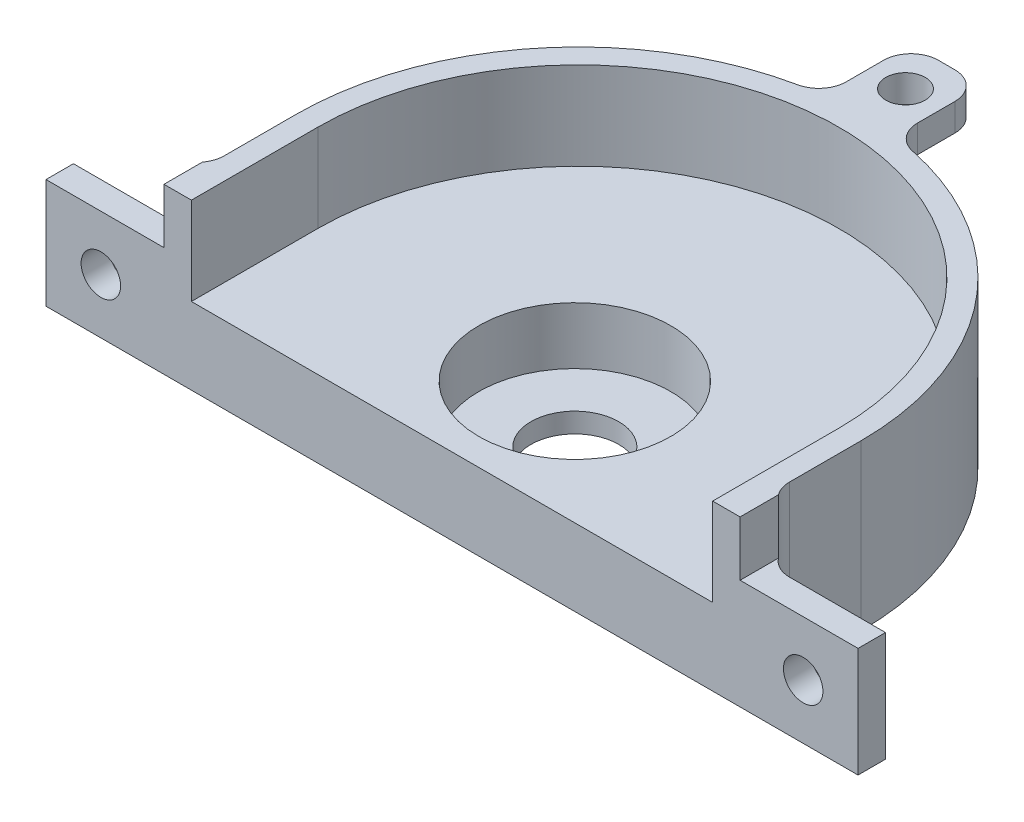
ISO-10303-21;
HEADER;
FILE_DESCRIPTION(('STEP AP214'),'2;1');
FILE_NAME('part.step','',(''),(''),'','','');
FILE_SCHEMA(('AUTOMOTIVE_DESIGN { 1 0 10303 214 1 1 1 1 }'));
ENDSEC;
DATA;
#1=APPLICATION_CONTEXT('core data for automotive mechanical design processes');
#2=APPLICATION_PROTOCOL_DEFINITION('international standard','automotive_design',2000,#1);
#3=PRODUCT_CONTEXT('',#1,'mechanical');
#4=PRODUCT('Part','Part','',(#3));
#5=PRODUCT_RELATED_PRODUCT_CATEGORY('part','',(#4));
#6=PRODUCT_DEFINITION_FORMATION('','',#4);
#7=PRODUCT_DEFINITION_CONTEXT('part definition',#1,'design');
#8=PRODUCT_DEFINITION('design','',#6,#7);
#9=PRODUCT_DEFINITION_SHAPE('','',#8);
#10=(LENGTH_UNIT() NAMED_UNIT(*) SI_UNIT(.MILLI.,.METRE.));
#11=(NAMED_UNIT(*) PLANE_ANGLE_UNIT() SI_UNIT($,.RADIAN.));
#12=(NAMED_UNIT(*) SI_UNIT($,.STERADIAN.) SOLID_ANGLE_UNIT());
#13=UNCERTAINTY_MEASURE_WITH_UNIT(LENGTH_MEASURE(1.E-05),#10,'distance_accuracy_value','');
#14=(GEOMETRIC_REPRESENTATION_CONTEXT(3) GLOBAL_UNCERTAINTY_ASSIGNED_CONTEXT((#13)) GLOBAL_UNIT_ASSIGNED_CONTEXT((#10,
#11,#12)) REPRESENTATION_CONTEXT('',''));
#15=CARTESIAN_POINT('',(0.,0.,0.));
#16=DIRECTION('',(0.,0.,1.));
#17=DIRECTION('',(1.,0.,0.));
#18=AXIS2_PLACEMENT_3D('',#15,#16,#17);
#19=CARTESIAN_POINT('',(50.8,19.05,-38.1));
#20=DIRECTION('',(0.,-1.,0.));
#21=DIRECTION('',(0.,0.,-1.));
#22=AXIS2_PLACEMENT_3D('',#19,#20,#21);
#23=PLANE('',#22);
#24=DIRECTION('',(0.,0.,-1.));
#25=VECTOR('',#24,1.);
#26=CARTESIAN_POINT('',(4.1275,19.05,-20.2865143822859));
#27=LINE('',#26,#25);
#28=CARTESIAN_POINT('',(4.1275,19.05,-12.7935143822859));
#29=VERTEX_POINT('',#28);
#30=CARTESIAN_POINT('',(4.1275,19.05,-17.1115143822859));
#31=VERTEX_POINT('',#30);
#32=EDGE_CURVE('E259',#29,#31,#27,.T.);
#33=ORIENTED_EDGE('',*,*,#32,.T.);
#34=CARTESIAN_POINT('',(0.9525,19.05,-17.1115143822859));
#35=DIRECTION('',(0.,-1.,0.));
#36=DIRECTION('',(0.,0.,-1.));
#37=AXIS2_PLACEMENT_3D('',#34,#35,#36);
#38=CIRCLE('',#37,3.175);
#39=CARTESIAN_POINT('',(0.9525,19.05,-20.2865143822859));
#40=VERTEX_POINT('',#39);
#41=EDGE_CURVE('E360',#31,#40,#38,.F.);
#42=ORIENTED_EDGE('',*,*,#41,.T.);
#43=DIRECTION('',(-1.,0.,0.));
#44=VECTOR('',#43,1.);
#45=CARTESIAN_POINT('',(-4.1275,19.05,-20.2865143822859));
#46=LINE('',#45,#44);
#47=CARTESIAN_POINT('',(-0.9525,19.05,-20.2865143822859));
#48=VERTEX_POINT('',#47);
#49=EDGE_CURVE('E261',#40,#48,#46,.T.);
#50=ORIENTED_EDGE('',*,*,#49,.T.);
#51=CARTESIAN_POINT('',(-0.9525,19.05,-17.1115143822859));
#52=DIRECTION('',(0.,-1.,0.));
#53=DIRECTION('',(0.,0.,-1.));
#54=AXIS2_PLACEMENT_3D('',#51,#52,#53);
#55=CIRCLE('',#54,3.175);
#56=CARTESIAN_POINT('',(-4.1275,19.05,-17.1115143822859));
#57=VERTEX_POINT('',#56);
#58=EDGE_CURVE('E358',#48,#57,#55,.F.);
#59=ORIENTED_EDGE('',*,*,#58,.T.);
#60=DIRECTION('',(0.,0.,1.));
#61=VECTOR('',#60,1.);
#62=CARTESIAN_POINT('',(-4.1275,19.05,-20.2865143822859));
#63=LINE('',#62,#61);
#64=CARTESIAN_POINT('',(-4.1275,19.05,-12.7935143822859));
#65=VERTEX_POINT('',#64);
#66=EDGE_CURVE('E264',#57,#65,#63,.T.);
#67=ORIENTED_EDGE('',*,*,#66,.T.);
#68=CARTESIAN_POINT('',(-7.3025,19.05,-12.7935143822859));
#69=DIRECTION('',(0.,-1.,0.));
#70=DIRECTION('',(0.,0.,-1.));
#71=AXIS2_PLACEMENT_3D('',#68,#69,#70);
#72=CIRCLE('',#71,3.175);
#73=CARTESIAN_POINT('',(-6.65626106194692,19.05,-9.68497771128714));
#74=VERTEX_POINT('',#73);
#75=EDGE_CURVE('E266',#65,#74,#72,.T.);
#76=ORIENTED_EDGE('',*,*,#75,.T.);
#77=CARTESIAN_POINT('',(0.,19.05,22.33295));
#78=DIRECTION('',(0.,1.,0.));
#79=DIRECTION('',(0.,0.,-1.));
#80=AXIS2_PLACEMENT_3D('',#77,#78,#79);
#81=CIRCLE('',#80,32.7025);
#82=CARTESIAN_POINT('',(-32.7025,19.05,22.33295));
#83=VERTEX_POINT('',#82);
#84=EDGE_CURVE('E269',#74,#83,#81,.T.);
#85=ORIENTED_EDGE('',*,*,#84,.T.);
#86=DIRECTION('',(0.,0.,1.));
#87=VECTOR('',#86,1.);
#88=CARTESIAN_POINT('',(-32.7025,19.05,30.607));
#89=LINE('',#88,#87);
#90=CARTESIAN_POINT('',(-32.7025,19.05,30.607));
#91=VERTEX_POINT('',#90);
#92=EDGE_CURVE('E272',#83,#91,#89,.T.);
#93=ORIENTED_EDGE('',*,*,#92,.T.);
#94=CARTESIAN_POINT('',(-35.8775,19.05,30.607));
#95=DIRECTION('',(0.,-1.,0.));
#96=DIRECTION('',(0.,0.,-1.));
#97=AXIS2_PLACEMENT_3D('',#94,#95,#96);
#98=CIRCLE('',#97,3.175);
#99=CARTESIAN_POINT('',(-33.3375,19.05,32.512));
#100=VERTEX_POINT('',#99);
#101=EDGE_CURVE('E275',#91,#100,#98,.T.);
#102=ORIENTED_EDGE('',*,*,#101,.T.);
#103=DIRECTION('',(0.,0.,1.));
#104=VECTOR('',#103,1.);
#105=CARTESIAN_POINT('',(-33.3375,19.05,-20.2865143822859));
#106=LINE('',#105,#104);
#107=CARTESIAN_POINT('',(-33.3375,19.05,36.957));
#108=VERTEX_POINT('',#107);
#109=EDGE_CURVE('E417',#100,#108,#106,.T.);
#110=ORIENTED_EDGE('',*,*,#109,.T.);
#111=DIRECTION('',(1.,0.,0.));
#112=VECTOR('',#111,1.);
#113=CARTESIAN_POINT('',(50.8,19.05,36.957));
#114=LINE('',#113,#112);
#115=CARTESIAN_POINT('',(-30.1625,19.05,36.957));
#116=VERTEX_POINT('',#115);
#117=EDGE_CURVE('E238',#108,#116,#114,.T.);
#118=ORIENTED_EDGE('',*,*,#117,.T.);
#119=DIRECTION('',(0.,0.,1.));
#120=VECTOR('',#119,1.);
#121=CARTESIAN_POINT('',(-30.1625,19.05,22.33295));
#122=LINE('',#121,#120);
#123=CARTESIAN_POINT('',(-30.1625,19.05,22.33295));
#124=VERTEX_POINT('',#123);
#125=EDGE_CURVE('E316',#124,#116,#122,.T.);
#126=ORIENTED_EDGE('',*,*,#125,.F.);
#127=CARTESIAN_POINT('',(0.,19.05,22.33295));
#128=DIRECTION('',(0.,1.,0.));
#129=DIRECTION('',(0.,0.,1.));
#130=AXIS2_PLACEMENT_3D('',#127,#128,#129);
#131=CIRCLE('',#130,30.1625);
#132=CARTESIAN_POINT('',(30.1625,19.05,22.33295));
#133=VERTEX_POINT('',#132);
#134=EDGE_CURVE('E311',#133,#124,#131,.T.);
#135=ORIENTED_EDGE('',*,*,#134,.F.);
#136=DIRECTION('',(0.,0.,1.));
#137=VECTOR('',#136,1.);
#138=CARTESIAN_POINT('',(30.1625,19.05,-38.1));
#139=LINE('',#138,#137);
#140=CARTESIAN_POINT('',(30.1625,19.05,36.957));
#141=VERTEX_POINT('',#140);
#142=EDGE_CURVE('E237',#133,#141,#139,.T.);
#143=ORIENTED_EDGE('',*,*,#142,.T.);
#144=CARTESIAN_POINT('',(33.3375,19.05,36.957));
#145=VERTEX_POINT('',#144);
#146=EDGE_CURVE('E227',#141,#145,#114,.T.);
#147=ORIENTED_EDGE('',*,*,#146,.T.);
#148=DIRECTION('',(0.,0.,1.));
#149=VECTOR('',#148,1.);
#150=CARTESIAN_POINT('',(33.3375,19.05,-20.2865143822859));
#151=LINE('',#150,#149);
#152=CARTESIAN_POINT('',(33.3375,19.05,32.512));
#153=VERTEX_POINT('',#152);
#154=EDGE_CURVE('E210',#153,#145,#151,.T.);
#155=ORIENTED_EDGE('',*,*,#154,.F.);
#156=CARTESIAN_POINT('',(35.8775,19.05,30.607));
#157=DIRECTION('',(0.,-1.,0.));
#158=DIRECTION('',(0.,0.,1.));
#159=AXIS2_PLACEMENT_3D('',#156,#157,#158);
#160=CIRCLE('',#159,3.175);
#161=CARTESIAN_POINT('',(32.7025,19.05,30.607));
#162=VERTEX_POINT('',#161);
#163=EDGE_CURVE('E241',#153,#162,#160,.T.);
#164=ORIENTED_EDGE('',*,*,#163,.T.);
#165=DIRECTION('',(0.,0.,-1.));
#166=VECTOR('',#165,1.);
#167=CARTESIAN_POINT('',(32.7025,19.05,30.607));
#168=LINE('',#167,#166);
#169=CARTESIAN_POINT('',(32.7025,19.05,22.33295));
#170=VERTEX_POINT('',#169);
#171=EDGE_CURVE('E250',#162,#170,#168,.T.);
#172=ORIENTED_EDGE('',*,*,#171,.T.);
#173=CARTESIAN_POINT('',(0.,19.05,22.33295));
#174=DIRECTION('',(0.,1.,0.));
#175=DIRECTION('',(0.,0.,1.));
#176=AXIS2_PLACEMENT_3D('',#173,#174,#175);
#177=CIRCLE('',#176,32.7025);
#178=CARTESIAN_POINT('',(6.6562610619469,19.05,-9.68497771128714));
#179=VERTEX_POINT('',#178);
#180=EDGE_CURVE('E253',#170,#179,#177,.T.);
#181=ORIENTED_EDGE('',*,*,#180,.T.);
#182=CARTESIAN_POINT('',(7.3025,19.05,-12.7935143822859));
#183=DIRECTION('',(0.,-1.,0.));
#184=DIRECTION('',(0.,0.,1.));
#185=AXIS2_PLACEMENT_3D('',#182,#183,#184);
#186=CIRCLE('',#185,3.175);
#187=EDGE_CURVE('E256',#179,#29,#186,.T.);
#188=ORIENTED_EDGE('',*,*,#187,.T.);
#189=EDGE_LOOP('',(#33,#42,#50,#59,#67,#76,#85,#93,#102,#110,#118,#126,#135,#143,#147,#155,#164,
#172,#181,#188));
#190=FACE_BOUND('',#189,.T.);
#191=CARTESIAN_POINT('',(0.,19.05,-15.5240143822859));
#192=DIRECTION('',(0.,1.,0.));
#193=DIRECTION('',(0.,0.,1.));
#194=AXIS2_PLACEMENT_3D('',#191,#192,#193);
#195=CIRCLE('',#194,2.286);
#196=CARTESIAN_POINT('',(0.,19.05,-17.8100143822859));
#197=VERTEX_POINT('',#196);
#198=EDGE_CURVE('E355',#197,#197,#195,.T.);
#199=ORIENTED_EDGE('',*,*,#198,.F.);
#200=EDGE_LOOP('',(#199));
#201=FACE_BOUND('',#200,.T.);
#202=ADVANCED_FACE('F35',(#190,#201),#23,.F.);
#203=CARTESIAN_POINT('',(0.,15.875,22.33295));
#204=DIRECTION('',(0.,1.,0.));
#205=DIRECTION('',(0.,0.,1.));
#206=AXIS2_PLACEMENT_3D('',#203,#204,#205);
#207=PLANE('',#206);
#208=DIRECTION('',(1.,0.,0.));
#209=VECTOR('',#208,1.);
#210=CARTESIAN_POINT('',(-4.1275,15.875,-20.2865143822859));
#211=LINE('',#210,#209);
#212=CARTESIAN_POINT('',(-0.9525,15.875,-20.2865143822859));
#213=VERTEX_POINT('',#212);
#214=CARTESIAN_POINT('',(0.9525,15.875,-20.2865143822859));
#215=VERTEX_POINT('',#214);
#216=EDGE_CURVE('E374',#213,#215,#211,.T.);
#217=ORIENTED_EDGE('',*,*,#216,.T.);
#218=CARTESIAN_POINT('',(0.9525,15.875,-17.1115143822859));
#219=DIRECTION('',(0.,1.,0.));
#220=DIRECTION('',(0.,0.,1.));
#221=AXIS2_PLACEMENT_3D('',#218,#219,#220);
#222=CIRCLE('',#221,3.175);
#223=CARTESIAN_POINT('',(4.1275,15.875,-17.1115143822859));
#224=VERTEX_POINT('',#223);
#225=EDGE_CURVE('E43',#215,#224,#222,.F.);
#226=ORIENTED_EDGE('',*,*,#225,.T.);
#227=DIRECTION('',(0.,0.,1.));
#228=VECTOR('',#227,1.);
#229=CARTESIAN_POINT('',(4.1275,15.875,-20.2865143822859));
#230=LINE('',#229,#228);
#231=CARTESIAN_POINT('',(4.1275,15.875,-12.7935143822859));
#232=VERTEX_POINT('',#231);
#233=EDGE_CURVE('E372',#224,#232,#230,.T.);
#234=ORIENTED_EDGE('',*,*,#233,.T.);
#235=CARTESIAN_POINT('',(7.3025,15.875,-12.7935143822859));
#236=DIRECTION('',(0.,1.,0.));
#237=DIRECTION('',(0.,0.,1.));
#238=AXIS2_PLACEMENT_3D('',#235,#236,#237);
#239=CIRCLE('',#238,3.175);
#240=CARTESIAN_POINT('',(6.6562610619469,15.875,-9.68497771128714));
#241=VERTEX_POINT('',#240);
#242=EDGE_CURVE('E381',#232,#241,#239,.T.);
#243=ORIENTED_EDGE('',*,*,#242,.T.);
#244=CARTESIAN_POINT('',(0.,15.875,22.33295));
#245=DIRECTION('',(0.,-1.,0.));
#246=DIRECTION('',(0.,0.,1.));
#247=AXIS2_PLACEMENT_3D('',#244,#245,#246);
#248=CIRCLE('',#247,32.7025);
#249=CARTESIAN_POINT('',(-6.6562610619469,15.875,-9.68497771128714));
#250=VERTEX_POINT('',#249);
#251=EDGE_CURVE('E597',#250,#241,#248,.T.);
#252=ORIENTED_EDGE('',*,*,#251,.F.);
#253=CARTESIAN_POINT('',(-7.3025,15.875,-12.7935143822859));
#254=DIRECTION('',(0.,1.,0.));
#255=DIRECTION('',(0.,0.,1.));
#256=AXIS2_PLACEMENT_3D('',#253,#254,#255);
#257=CIRCLE('',#256,3.175);
#258=CARTESIAN_POINT('',(-4.1275,15.875,-12.7935143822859));
#259=VERTEX_POINT('',#258);
#260=EDGE_CURVE('E602',#250,#259,#257,.T.);
#261=ORIENTED_EDGE('',*,*,#260,.T.);
#262=DIRECTION('',(0.,0.,-1.));
#263=VECTOR('',#262,1.);
#264=CARTESIAN_POINT('',(-4.1275,15.875,-20.2865143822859));
#265=LINE('',#264,#263);
#266=CARTESIAN_POINT('',(-4.1275,15.875,-17.1115143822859));
#267=VERTEX_POINT('',#266);
#268=EDGE_CURVE('E391',#259,#267,#265,.T.);
#269=ORIENTED_EDGE('',*,*,#268,.T.);
#270=CARTESIAN_POINT('',(-0.9525,15.875,-17.1115143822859));
#271=DIRECTION('',(0.,1.,0.));
#272=DIRECTION('',(0.,0.,1.));
#273=AXIS2_PLACEMENT_3D('',#270,#271,#272);
#274=CIRCLE('',#273,3.175);
#275=EDGE_CURVE('E366',#267,#213,#274,.F.);
#276=ORIENTED_EDGE('',*,*,#275,.T.);
#277=EDGE_LOOP('',(#217,#226,#234,#243,#252,#261,#269,#276));
#278=FACE_BOUND('',#277,.T.);
#279=CARTESIAN_POINT('',(0.,15.875,-15.5240143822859));
#280=DIRECTION('',(0.,1.,0.));
#281=DIRECTION('',(0.,0.,1.));
#282=AXIS2_PLACEMENT_3D('',#279,#280,#281);
#283=CIRCLE('',#282,2.286);
#284=CARTESIAN_POINT('',(0.,15.875,-17.8100143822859));
#285=VERTEX_POINT('',#284);
#286=EDGE_CURVE('E231',#285,#285,#283,.F.);
#287=ORIENTED_EDGE('',*,*,#286,.F.);
#288=EDGE_LOOP('',(#287));
#289=FACE_BOUND('',#288,.T.);
#290=ADVANCED_FACE('F370',(#278,#289),#207,.F.);
#291=CARTESIAN_POINT('',(50.8,0.,36.957));
#292=DIRECTION('',(0.,0.,1.));
#293=DIRECTION('',(1.,0.,0.));
#294=AXIS2_PLACEMENT_3D('',#291,#292,#293);
#295=PLANE('',#294);
#296=DIRECTION('',(0.,-1.,0.));
#297=VECTOR('',#296,1.);
#298=CARTESIAN_POINT('',(46.99,0.,36.957));
#299=LINE('',#298,#297);
#300=CARTESIAN_POINT('',(46.99,12.7,36.957));
#301=VERTEX_POINT('',#300);
#302=CARTESIAN_POINT('',(46.99,0.,36.957));
#303=VERTEX_POINT('',#302);
#304=EDGE_CURVE('E221',#301,#303,#299,.T.);
#305=ORIENTED_EDGE('',*,*,#304,.F.);
#306=DIRECTION('',(1.,0.,0.));
#307=VECTOR('',#306,1.);
#308=CARTESIAN_POINT('',(46.99,12.7,36.957));
#309=LINE('',#308,#307);
#310=CARTESIAN_POINT('',(33.3375,12.7,36.957));
#311=VERTEX_POINT('',#310);
#312=EDGE_CURVE('E230',#311,#301,#309,.T.);
#313=ORIENTED_EDGE('',*,*,#312,.F.);
#314=DIRECTION('',(0.,-1.,0.));
#315=VECTOR('',#314,1.);
#316=CARTESIAN_POINT('',(33.3375,12.7,36.957));
#317=LINE('',#316,#315);
#318=EDGE_CURVE('E213',#145,#311,#317,.T.);
#319=ORIENTED_EDGE('',*,*,#318,.F.);
#320=ORIENTED_EDGE('',*,*,#146,.F.);
#321=DIRECTION('',(0.,-1.,0.));
#322=VECTOR('',#321,1.);
#323=CARTESIAN_POINT('',(30.1625,8.89,36.957));
#324=LINE('',#323,#322);
#325=CARTESIAN_POINT('',(30.1625,8.89,36.957));
#326=VERTEX_POINT('',#325);
#327=EDGE_CURVE('E306',#141,#326,#324,.T.);
#328=ORIENTED_EDGE('',*,*,#327,.T.);
#329=DIRECTION('',(1.,0.,0.));
#330=VECTOR('',#329,1.);
#331=CARTESIAN_POINT('',(0.,8.89,36.957));
#332=LINE('',#331,#330);
#333=CARTESIAN_POINT('',(-30.1625,8.89,36.957));
#334=VERTEX_POINT('',#333);
#335=EDGE_CURVE('E282',#334,#326,#332,.T.);
#336=ORIENTED_EDGE('',*,*,#335,.F.);
#337=DIRECTION('',(0.,1.,0.));
#338=VECTOR('',#337,1.);
#339=CARTESIAN_POINT('',(-30.1625,8.89,36.957));
#340=LINE('',#339,#338);
#341=EDGE_CURVE('E331',#334,#116,#340,.T.);
#342=ORIENTED_EDGE('',*,*,#341,.T.);
#343=ORIENTED_EDGE('',*,*,#117,.F.);
#344=DIRECTION('',(0.,1.,0.));
#345=VECTOR('',#344,1.);
#346=CARTESIAN_POINT('',(-33.3375,12.7,36.957));
#347=LINE('',#346,#345);
#348=CARTESIAN_POINT('',(-33.3375,12.7,36.957));
#349=VERTEX_POINT('',#348);
#350=EDGE_CURVE('E426',#349,#108,#347,.T.);
#351=ORIENTED_EDGE('',*,*,#350,.F.);
#352=DIRECTION('',(1.,0.,0.));
#353=VECTOR('',#352,1.);
#354=CARTESIAN_POINT('',(-46.99,12.7,36.957));
#355=LINE('',#354,#353);
#356=CARTESIAN_POINT('',(-46.99,12.7,36.957));
#357=VERTEX_POINT('',#356);
#358=EDGE_CURVE('E591',#357,#349,#355,.T.);
#359=ORIENTED_EDGE('',*,*,#358,.F.);
#360=DIRECTION('',(0.,1.,0.));
#361=VECTOR('',#360,1.);
#362=CARTESIAN_POINT('',(-46.99,0.,36.957));
#363=LINE('',#362,#361);
#364=CARTESIAN_POINT('',(-46.99,0.,36.957));
#365=VERTEX_POINT('',#364);
#366=EDGE_CURVE('E622',#365,#357,#363,.T.);
#367=ORIENTED_EDGE('',*,*,#366,.F.);
#368=DIRECTION('',(1.,0.,0.));
#369=VECTOR('',#368,1.);
#370=CARTESIAN_POINT('',(-50.8,0.,36.957));
#371=LINE('',#370,#369);
#372=EDGE_CURVE('E278',#365,#303,#371,.T.);
#373=ORIENTED_EDGE('',*,*,#372,.T.);
#374=EDGE_LOOP('',(#305,#313,#319,#320,#328,#336,#342,#343,#351,#359,#367,#373));
#375=FACE_BOUND('',#374,.T.);
#376=CARTESIAN_POINT('',(-40.64,6.35,36.957));
#377=DIRECTION('',(0.,0.,1.));
#378=DIRECTION('',(1.,0.,0.));
#379=AXIS2_PLACEMENT_3D('',#376,#377,#378);
#380=CIRCLE('',#379,2.28599999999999);
#381=CARTESIAN_POINT('',(-38.354,6.35,36.957));
#382=VERTEX_POINT('',#381);
#383=EDGE_CURVE('E339',#382,#382,#380,.T.);
#384=ORIENTED_EDGE('',*,*,#383,.F.);
#385=EDGE_LOOP('',(#384));
#386=FACE_BOUND('',#385,.T.);
#387=CARTESIAN_POINT('',(40.64,6.35,36.957));
#388=DIRECTION('',(0.,0.,1.));
#389=DIRECTION('',(-1.,0.,0.));
#390=AXIS2_PLACEMENT_3D('',#387,#388,#389);
#391=CIRCLE('',#390,2.28599999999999);
#392=CARTESIAN_POINT('',(38.354,6.35,36.957));
#393=VERTEX_POINT('',#392);
#394=EDGE_CURVE('E343',#393,#393,#391,.T.);
#395=ORIENTED_EDGE('',*,*,#394,.F.);
#396=EDGE_LOOP('',(#395));
#397=FACE_BOUND('',#396,.T.);
#398=ADVANCED_FACE('F225',(#375,#386,#397),#295,.T.);
#399=CARTESIAN_POINT('',(50.8,0.,33.782));
#400=DIRECTION('',(0.,0.,-1.));
#401=DIRECTION('',(-1.,0.,0.));
#402=AXIS2_PLACEMENT_3D('',#399,#400,#401);
#403=PLANE('',#402);
#404=DIRECTION('',(0.,1.,0.));
#405=VECTOR('',#404,1.);
#406=CARTESIAN_POINT('',(46.99,0.,33.782));
#407=LINE('',#406,#405);
#408=CARTESIAN_POINT('',(46.99,0.,33.782));
#409=VERTEX_POINT('',#408);
#410=CARTESIAN_POINT('',(46.99,12.7,33.782));
#411=VERTEX_POINT('',#410);
#412=EDGE_CURVE('E620',#409,#411,#407,.T.);
#413=ORIENTED_EDGE('',*,*,#412,.F.);
#414=DIRECTION('',(-1.,0.,0.));
#415=VECTOR('',#414,1.);
#416=CARTESIAN_POINT('',(50.8,0.,33.782));
#417=LINE('',#416,#415);
#418=CARTESIAN_POINT('',(35.8775,0.,33.782));
#419=VERTEX_POINT('',#418);
#420=EDGE_CURVE('E565',#409,#419,#417,.T.);
#421=ORIENTED_EDGE('',*,*,#420,.T.);
#422=DIRECTION('',(0.,1.,0.));
#423=VECTOR('',#422,1.);
#424=CARTESIAN_POINT('',(35.8775,0.,33.782));
#425=LINE('',#424,#423);
#426=CARTESIAN_POINT('',(35.8775,12.7,33.782));
#427=VERTEX_POINT('',#426);
#428=EDGE_CURVE('E301',#419,#427,#425,.T.);
#429=ORIENTED_EDGE('',*,*,#428,.T.);
#430=DIRECTION('',(-1.,0.,0.));
#431=VECTOR('',#430,1.);
#432=CARTESIAN_POINT('',(50.8,12.7,33.782));
#433=LINE('',#432,#431);
#434=EDGE_CURVE('E619',#411,#427,#433,.T.);
#435=ORIENTED_EDGE('',*,*,#434,.F.);
#436=EDGE_LOOP('',(#413,#421,#429,#435));
#437=FACE_BOUND('',#436,.T.);
#438=CARTESIAN_POINT('',(40.64,6.35,33.782));
#439=DIRECTION('',(0.,0.,-1.));
#440=DIRECTION('',(-1.,0.,0.));
#441=AXIS2_PLACEMENT_3D('',#438,#439,#440);
#442=CIRCLE('',#441,2.28599999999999);
#443=CARTESIAN_POINT('',(38.354,6.35,33.782));
#444=VERTEX_POINT('',#443);
#445=EDGE_CURVE('E340',#444,#444,#442,.F.);
#446=ORIENTED_EDGE('',*,*,#445,.T.);
#447=EDGE_LOOP('',(#446));
#448=FACE_BOUND('',#447,.T.);
#449=ADVANCED_FACE('F516',(#437,#448),#403,.T.);
#450=CARTESIAN_POINT('',(-50.8,0.,33.782));
#451=DIRECTION('',(0.,0.,-1.));
#452=DIRECTION('',(-1.,0.,0.));
#453=AXIS2_PLACEMENT_3D('',#450,#451,#452);
#454=PLANE('',#453);
#455=DIRECTION('',(-1.,0.,0.));
#456=VECTOR('',#455,1.);
#457=CARTESIAN_POINT('',(-50.8,12.7,33.782));
#458=LINE('',#457,#456);
#459=CARTESIAN_POINT('',(-35.8775,12.7,33.782));
#460=VERTEX_POINT('',#459);
#461=CARTESIAN_POINT('',(-46.99,12.7,33.782));
#462=VERTEX_POINT('',#461);
#463=EDGE_CURVE('E421',#460,#462,#458,.T.);
#464=ORIENTED_EDGE('',*,*,#463,.F.);
#465=DIRECTION('',(0.,1.,0.));
#466=VECTOR('',#465,1.);
#467=CARTESIAN_POINT('',(-35.8775,0.,33.782));
#468=LINE('',#467,#466);
#469=CARTESIAN_POINT('',(-35.8775,0.,33.782));
#470=VERTEX_POINT('',#469);
#471=EDGE_CURVE('E279',#470,#460,#468,.T.);
#472=ORIENTED_EDGE('',*,*,#471,.F.);
#473=DIRECTION('',(-1.,0.,0.));
#474=VECTOR('',#473,1.);
#475=CARTESIAN_POINT('',(-50.8,0.,33.782));
#476=LINE('',#475,#474);
#477=CARTESIAN_POINT('',(-46.99,0.,33.782));
#478=VERTEX_POINT('',#477);
#479=EDGE_CURVE('E247',#470,#478,#476,.T.);
#480=ORIENTED_EDGE('',*,*,#479,.T.);
#481=DIRECTION('',(0.,-1.,0.));
#482=VECTOR('',#481,1.);
#483=CARTESIAN_POINT('',(-46.99,0.,33.782));
#484=LINE('',#483,#482);
#485=EDGE_CURVE('E580',#462,#478,#484,.T.);
#486=ORIENTED_EDGE('',*,*,#485,.F.);
#487=EDGE_LOOP('',(#464,#472,#480,#486));
#488=FACE_BOUND('',#487,.T.);
#489=CARTESIAN_POINT('',(-40.64,6.35,33.782));
#490=DIRECTION('',(0.,0.,-1.));
#491=DIRECTION('',(-1.,0.,0.));
#492=AXIS2_PLACEMENT_3D('',#489,#490,#491);
#493=CIRCLE('',#492,2.28599999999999);
#494=CARTESIAN_POINT('',(-42.926,6.35,33.782));
#495=VERTEX_POINT('',#494);
#496=EDGE_CURVE('E335',#495,#495,#493,.F.);
#497=ORIENTED_EDGE('',*,*,#496,.T.);
#498=EDGE_LOOP('',(#497));
#499=FACE_BOUND('',#498,.T.);
#500=ADVANCED_FACE('F513',(#488,#499),#454,.T.);
#501=CARTESIAN_POINT('',(0.,19.05,22.7457));
#502=DIRECTION('',(0.,-1.,0.));
#503=DIRECTION('',(0.,0.,-1.));
#504=AXIS2_PLACEMENT_3D('',#501,#502,#503);
#505=CYLINDRICAL_SURFACE('',#504,5.08);
#506=CARTESIAN_POINT('',(0.,0.,22.7457));
#507=DIRECTION('',(0.,1.,0.));
#508=DIRECTION('',(0.,0.,1.));
#509=AXIS2_PLACEMENT_3D('',#506,#507,#508);
#510=CIRCLE('',#509,5.08);
#511=CARTESIAN_POINT('',(0.,0.,17.6657));
#512=VERTEX_POINT('',#511);
#513=EDGE_CURVE('E308',#512,#512,#510,.T.);
#514=CARTESIAN_POINT('',(0.,2.286,22.7457));
#515=DIRECTION('',(0.,1.,0.));
#516=DIRECTION('',(0.,0.,1.));
#517=AXIS2_PLACEMENT_3D('',#514,#515,#516);
#518=CIRCLE('',#517,5.08);
#519=CARTESIAN_POINT('',(0.,2.286,17.6657));
#520=VERTEX_POINT('',#519);
#521=EDGE_CURVE('E239',#520,#520,#518,.T.);
#522=CARTESIAN_POINT('',(0.,0.,17.6657));
#523=CARTESIAN_POINT('',(0.,0.0238125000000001,17.6657));
#524=CARTESIAN_POINT('',(0.,0.0476250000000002,17.6657));
#525=CARTESIAN_POINT('',(0.,0.0952500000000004,17.6657));
#526=CARTESIAN_POINT('',(0.,0.119062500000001,17.6657));
#527=CARTESIAN_POINT('',(0.,0.166687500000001,17.6657));
#528=CARTESIAN_POINT('',(0.,0.190500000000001,17.6657));
#529=CARTESIAN_POINT('',(0.,0.238125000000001,17.6657));
#530=CARTESIAN_POINT('',(0.,0.261937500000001,17.6657));
#531=CARTESIAN_POINT('',(0.,0.3095625,17.6657));
#532=CARTESIAN_POINT('',(0.,0.333374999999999,17.6657));
#533=CARTESIAN_POINT('',(0.,0.380999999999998,17.6657));
#534=CARTESIAN_POINT('',(0.,0.404812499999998,17.6657));
#535=CARTESIAN_POINT('',(0.,0.452437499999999,17.6657));
#536=CARTESIAN_POINT('',(0.,0.476249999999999,17.6657));
#537=CARTESIAN_POINT('',(0.,0.523874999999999,17.6657));
#538=CARTESIAN_POINT('',(0.,0.547687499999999,17.6657));
#539=CARTESIAN_POINT('',(0.,0.595312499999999,17.6657));
#540=CARTESIAN_POINT('',(0.,0.619124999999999,17.6657));
#541=CARTESIAN_POINT('',(0.,0.66675,17.6657));
#542=CARTESIAN_POINT('',(0.,0.6905625,17.6657));
#543=CARTESIAN_POINT('',(0.,0.7381875,17.6657));
#544=CARTESIAN_POINT('',(0.,0.762,17.6657));
#545=CARTESIAN_POINT('',(0.,0.809624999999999,17.6657));
#546=CARTESIAN_POINT('',(0.,0.833437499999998,17.6657));
#547=CARTESIAN_POINT('',(0.,0.881062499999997,17.6657));
#548=CARTESIAN_POINT('',(0.,0.904874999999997,17.6657));
#549=CARTESIAN_POINT('',(0.,0.952499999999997,17.6657));
#550=CARTESIAN_POINT('',(0.,0.976312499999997,17.6657));
#551=CARTESIAN_POINT('',(0.,1.0239375,17.6657));
#552=CARTESIAN_POINT('',(0.,1.04775,17.6657));
#553=CARTESIAN_POINT('',(0.,1.095375,17.6657));
#554=CARTESIAN_POINT('',(0.,1.1191875,17.6657));
#555=CARTESIAN_POINT('',(0.,1.1668125,17.6657));
#556=CARTESIAN_POINT('',(0.,1.190625,17.6657));
#557=CARTESIAN_POINT('',(0.,1.23825,17.6657));
#558=CARTESIAN_POINT('',(0.,1.2620625,17.6657));
#559=CARTESIAN_POINT('',(0.,1.3096875,17.6657));
#560=CARTESIAN_POINT('',(0.,1.3335,17.6657));
#561=CARTESIAN_POINT('',(0.,1.381125,17.6657));
#562=CARTESIAN_POINT('',(0.,1.4049375,17.6657));
#563=CARTESIAN_POINT('',(0.,1.4525625,17.6657));
#564=CARTESIAN_POINT('',(0.,1.476375,17.6657));
#565=CARTESIAN_POINT('',(0.,1.524,17.6657));
#566=CARTESIAN_POINT('',(0.,1.5478125,17.6657));
#567=CARTESIAN_POINT('',(0.,1.5954375,17.6657));
#568=CARTESIAN_POINT('',(0.,1.61925,17.6657));
#569=CARTESIAN_POINT('',(0.,1.666875,17.6657));
#570=CARTESIAN_POINT('',(0.,1.6906875,17.6657));
#571=CARTESIAN_POINT('',(0.,1.7383125,17.6657));
#572=CARTESIAN_POINT('',(0.,1.762125,17.6657));
#573=CARTESIAN_POINT('',(0.,1.80975,17.6657));
#574=CARTESIAN_POINT('',(0.,1.8335625,17.6657));
#575=CARTESIAN_POINT('',(0.,1.8811875,17.6657));
#576=CARTESIAN_POINT('',(0.,1.905,17.6657));
#577=CARTESIAN_POINT('',(0.,1.952625,17.6657));
#578=CARTESIAN_POINT('',(0.,1.9764375,17.6657));
#579=CARTESIAN_POINT('',(0.,2.02406249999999,17.6657));
#580=CARTESIAN_POINT('',(0.,2.047875,17.6657));
#581=CARTESIAN_POINT('',(0.,2.0955,17.6657));
#582=CARTESIAN_POINT('',(0.,2.1193125,17.6657));
#583=CARTESIAN_POINT('',(0.,2.1669375,17.6657));
#584=CARTESIAN_POINT('',(0.,2.19075,17.6657));
#585=CARTESIAN_POINT('',(0.,2.238375,17.6657));
#586=CARTESIAN_POINT('',(0.,2.2621875,17.6657));
#587=CARTESIAN_POINT('',(0.,2.286,17.6657));
#588=B_SPLINE_CURVE_WITH_KNOTS('',3,(#522,#523,#524,#525,#526,#527,#528,#529,#530,#531,#532,
#533,#534,#535,#536,#537,#538,#539,#540,#541,#542,#543,#544,#545,#546,#547,#548,#549,#550,#551,
#552,#553,#554,#555,#556,#557,#558,#559,#560,#561,#562,#563,#564,#565,#566,#567,#568,#569,#570,
#571,#572,#573,#574,#575,#576,#577,#578,#579,#580,#581,#582,#583,#584,#585,#586,#587),
.UNSPECIFIED.,.F.,.F.,(4,2,2,2,2,2,2,2,2,2,2,2,2,2,2,2,2,2,2,2,2,2,2,2,2,2,2,2,2,2,2,2,4),(0.,
0.0714375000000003,0.142875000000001,0.214312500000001,0.285750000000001,0.357187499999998,
0.428624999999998,0.500062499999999,0.571499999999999,0.642937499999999,0.714375,0.7858125,
0.857249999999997,0.928687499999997,1.000125,1.0715625,1.143,1.2144375,1.285875,1.3573125,
1.42875,1.5001875,1.571625,1.6430625,1.7145,1.7859375,1.857375,1.9288125,2.00024999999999,
2.0716875,2.143125,2.2145625,2.286),.UNSPECIFIED.);
#589=EDGE_CURVE('BSEAM449',#512,#520,#588,.T.);
#590=ORIENTED_EDGE('',*,*,#513,.F.);
#591=ORIENTED_EDGE('',*,*,#521,.T.);
#592=ORIENTED_EDGE('',*,*,#589,.T.);
#593=ORIENTED_EDGE('',*,*,#589,.F.);
#594=EDGE_LOOP('',(#590,#592,#591,#593));
#595=FACE_BOUND('',#594,.T.);
#596=ADVANCED_FACE('F449',(#595),#505,.F.);
#597=CARTESIAN_POINT('',(50.8,0.,-38.1));
#598=DIRECTION('',(0.,-1.,0.));
#599=DIRECTION('',(0.,0.,-1.));
#600=AXIS2_PLACEMENT_3D('',#597,#598,#599);
#601=PLANE('',#600);
#602=DIRECTION('',(0.,0.,1.));
#603=VECTOR('',#602,1.);
#604=CARTESIAN_POINT('',(46.99,0.,-20.2865143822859));
#605=LINE('',#604,#603);
#606=EDGE_CURVE('E625',#409,#303,#605,.T.);
#607=ORIENTED_EDGE('',*,*,#606,.T.);
#608=ORIENTED_EDGE('',*,*,#372,.F.);
#609=DIRECTION('',(0.,0.,1.));
#610=VECTOR('',#609,1.);
#611=CARTESIAN_POINT('',(-46.99,0.,-20.2865143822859));
#612=LINE('',#611,#610);
#613=EDGE_CURVE('E585',#478,#365,#612,.T.);
#614=ORIENTED_EDGE('',*,*,#613,.F.);
#615=ORIENTED_EDGE('',*,*,#479,.F.);
#616=CARTESIAN_POINT('',(-35.8775,0.,30.607));
#617=DIRECTION('',(0.,-1.,0.));
#618=DIRECTION('',(0.,0.,-1.));
#619=AXIS2_PLACEMENT_3D('',#616,#617,#618);
#620=CIRCLE('',#619,3.175);
#621=CARTESIAN_POINT('',(-32.7025,0.,30.607));
#622=VERTEX_POINT('',#621);
#623=EDGE_CURVE('E574',#622,#470,#620,.T.);
#624=ORIENTED_EDGE('',*,*,#623,.F.);
#625=DIRECTION('',(0.,0.,1.));
#626=VECTOR('',#625,1.);
#627=CARTESIAN_POINT('',(-32.7025,0.,30.607));
#628=LINE('',#627,#626);
#629=CARTESIAN_POINT('',(-32.7025,0.,22.33295));
#630=VERTEX_POINT('',#629);
#631=EDGE_CURVE('E409',#630,#622,#628,.T.);
#632=ORIENTED_EDGE('',*,*,#631,.F.);
#633=CARTESIAN_POINT('',(0.,0.,22.33295));
#634=DIRECTION('',(0.,1.,0.));
#635=DIRECTION('',(0.,0.,1.));
#636=AXIS2_PLACEMENT_3D('',#633,#634,#635);
#637=CIRCLE('',#636,32.7025);
#638=CARTESIAN_POINT('',(32.7025,0.,22.33295));
#639=VERTEX_POINT('',#638);
#640=EDGE_CURVE('E403',#639,#630,#637,.T.);
#641=ORIENTED_EDGE('',*,*,#640,.F.);
#642=DIRECTION('',(0.,0.,-1.));
#643=VECTOR('',#642,1.);
#644=CARTESIAN_POINT('',(32.7025,0.,30.607));
#645=LINE('',#644,#643);
#646=CARTESIAN_POINT('',(32.7025,0.,30.607));
#647=VERTEX_POINT('',#646);
#648=EDGE_CURVE('E570',#647,#639,#645,.T.);
#649=ORIENTED_EDGE('',*,*,#648,.F.);
#650=CARTESIAN_POINT('',(35.8775,0.,30.607));
#651=DIRECTION('',(0.,-1.,0.));
#652=DIRECTION('',(0.,0.,1.));
#653=AXIS2_PLACEMENT_3D('',#650,#651,#652);
#654=CIRCLE('',#653,3.175);
#655=EDGE_CURVE('E567',#419,#647,#654,.T.);
#656=ORIENTED_EDGE('',*,*,#655,.F.);
#657=ORIENTED_EDGE('',*,*,#420,.F.);
#658=EDGE_LOOP('',(#607,#608,#614,#615,#624,#632,#641,#649,#656,#657));
#659=FACE_BOUND('',#658,.T.);
#660=ORIENTED_EDGE('',*,*,#513,.T.);
#661=EDGE_LOOP('',(#660));
#662=FACE_BOUND('',#661,.T.);
#663=ADVANCED_FACE('F441',(#659,#662),#601,.T.);
#664=CARTESIAN_POINT('',(0.,8.89,22.33295));
#665=DIRECTION('',(0.,1.,0.));
#666=DIRECTION('',(0.,0.,1.));
#667=AXIS2_PLACEMENT_3D('',#664,#665,#666);
#668=PLANE('',#667);
#669=CARTESIAN_POINT('',(0.,8.89,22.7457));
#670=DIRECTION('',(0.,1.,0.));
#671=DIRECTION('',(0.,0.,1.));
#672=AXIS2_PLACEMENT_3D('',#669,#670,#671);
#673=CIRCLE('',#672,11.1125);
#674=CARTESIAN_POINT('',(0.,8.89,33.8582));
#675=VERTEX_POINT('',#674);
#676=EDGE_CURVE('E338',#675,#675,#673,.T.);
#677=ORIENTED_EDGE('',*,*,#676,.F.);
#678=EDGE_LOOP('',(#677));
#679=FACE_BOUND('',#678,.T.);
#680=DIRECTION('',(0.,0.,1.));
#681=VECTOR('',#680,1.);
#682=CARTESIAN_POINT('',(-30.1625,8.89,22.33295));
#683=LINE('',#682,#681);
#684=CARTESIAN_POINT('',(-30.1625,8.89,22.33295));
#685=VERTEX_POINT('',#684);
#686=EDGE_CURVE('E315',#685,#334,#683,.T.);
#687=ORIENTED_EDGE('',*,*,#686,.T.);
#688=ORIENTED_EDGE('',*,*,#335,.T.);
#689=DIRECTION('',(0.,0.,-1.));
#690=VECTOR('',#689,1.);
#691=CARTESIAN_POINT('',(30.1625,8.89,22.33295));
#692=LINE('',#691,#690);
#693=CARTESIAN_POINT('',(30.1625,8.89,22.33295));
#694=VERTEX_POINT('',#693);
#695=EDGE_CURVE('E319',#326,#694,#692,.T.);
#696=ORIENTED_EDGE('',*,*,#695,.T.);
#697=CARTESIAN_POINT('',(0.,8.89,22.33295));
#698=DIRECTION('',(0.,1.,0.));
#699=DIRECTION('',(0.,0.,1.));
#700=AXIS2_PLACEMENT_3D('',#697,#698,#699);
#701=CIRCLE('',#700,30.1625);
#702=EDGE_CURVE('E312',#694,#685,#701,.T.);
#703=ORIENTED_EDGE('',*,*,#702,.T.);
#704=EDGE_LOOP('',(#687,#688,#696,#703));
#705=FACE_BOUND('',#704,.T.);
#706=ADVANCED_FACE('F439',(#679,#705),#668,.T.);
#707=CARTESIAN_POINT('',(30.1625,8.89,22.33295));
#708=DIRECTION('',(1.,0.,0.));
#709=DIRECTION('',(0.,0.,-1.));
#710=AXIS2_PLACEMENT_3D('',#707,#708,#709);
#711=PLANE('',#710);
#712=ORIENTED_EDGE('',*,*,#327,.F.);
#713=ORIENTED_EDGE('',*,*,#142,.F.);
#714=DIRECTION('',(0.,1.,0.));
#715=VECTOR('',#714,1.);
#716=CARTESIAN_POINT('',(30.1625,8.89,22.33295));
#717=LINE('',#716,#715);
#718=EDGE_CURVE('E325',#694,#133,#717,.T.);
#719=ORIENTED_EDGE('',*,*,#718,.F.);
#720=ORIENTED_EDGE('',*,*,#695,.F.);
#721=EDGE_LOOP('',(#712,#713,#719,#720));
#722=FACE_BOUND('',#721,.T.);
#723=ADVANCED_FACE('F437',(#722),#711,.F.);
#724=CARTESIAN_POINT('',(-30.1625,8.89,22.33295));
#725=DIRECTION('',(-1.,0.,0.));
#726=DIRECTION('',(0.,0.,1.));
#727=AXIS2_PLACEMENT_3D('',#724,#725,#726);
#728=PLANE('',#727);
#729=ORIENTED_EDGE('',*,*,#341,.F.);
#730=ORIENTED_EDGE('',*,*,#686,.F.);
#731=DIRECTION('',(0.,1.,0.));
#732=VECTOR('',#731,1.);
#733=CARTESIAN_POINT('',(-30.1625,8.89,22.33295));
#734=LINE('',#733,#732);
#735=EDGE_CURVE('E321',#685,#124,#734,.T.);
#736=ORIENTED_EDGE('',*,*,#735,.T.);
#737=ORIENTED_EDGE('',*,*,#125,.T.);
#738=EDGE_LOOP('',(#729,#730,#736,#737));
#739=FACE_BOUND('',#738,.T.);
#740=ADVANCED_FACE('F430',(#739),#728,.F.);
#741=CARTESIAN_POINT('',(0.,8.89,22.33295));
#742=DIRECTION('',(0.,1.,0.));
#743=DIRECTION('',(0.,0.,1.));
#744=AXIS2_PLACEMENT_3D('',#741,#742,#743);
#745=CYLINDRICAL_SURFACE('',#744,30.1625);
#746=ORIENTED_EDGE('',*,*,#134,.T.);
#747=ORIENTED_EDGE('',*,*,#735,.F.);
#748=ORIENTED_EDGE('',*,*,#702,.F.);
#749=ORIENTED_EDGE('',*,*,#718,.T.);
#750=EDGE_LOOP('',(#746,#747,#748,#749));
#751=FACE_BOUND('',#750,.T.);
#752=ADVANCED_FACE('F432',(#751),#745,.F.);
#753=CARTESIAN_POINT('',(-35.8775,0.,30.607));
#754=DIRECTION('',(0.,1.,0.));
#755=DIRECTION('',(0.,0.,1.));
#756=AXIS2_PLACEMENT_3D('',#753,#754,#755);
#757=CYLINDRICAL_SURFACE('',#756,3.175);
#758=DIRECTION('',(0.,1.,0.));
#759=VECTOR('',#758,1.);
#760=CARTESIAN_POINT('',(-33.3375,0.,32.512));
#761=LINE('',#760,#759);
#762=CARTESIAN_POINT('',(-33.3375,12.7,32.512));
#763=VERTEX_POINT('',#762);
#764=EDGE_CURVE('E345',#100,#763,#761,.F.);
#765=ORIENTED_EDGE('',*,*,#764,.F.);
#766=ORIENTED_EDGE('',*,*,#101,.F.);
#767=DIRECTION('',(0.,1.,0.));
#768=VECTOR('',#767,1.);
#769=CARTESIAN_POINT('',(-32.7025,0.,30.607));
#770=LINE('',#769,#768);
#771=EDGE_CURVE('E283',#622,#91,#770,.T.);
#772=ORIENTED_EDGE('',*,*,#771,.F.);
#773=ORIENTED_EDGE('',*,*,#623,.T.);
#774=ORIENTED_EDGE('',*,*,#471,.T.);
#775=CARTESIAN_POINT('',(-35.8775,12.7,30.607));
#776=DIRECTION('',(0.,-1.,0.));
#777=DIRECTION('',(1.,0.,0.));
#778=AXIS2_PLACEMENT_3D('',#775,#776,#777);
#779=CIRCLE('',#778,3.175);
#780=EDGE_CURVE('E333',#763,#460,#779,.T.);
#781=ORIENTED_EDGE('',*,*,#780,.F.);
#782=EDGE_LOOP('',(#765,#766,#772,#773,#774,#781));
#783=FACE_BOUND('',#782,.T.);
#784=ADVANCED_FACE('F414',(#783),#757,.F.);
#785=CARTESIAN_POINT('',(-32.7025,0.,30.607));
#786=DIRECTION('',(-1.,0.,0.));
#787=DIRECTION('',(0.,0.,1.));
#788=AXIS2_PLACEMENT_3D('',#785,#786,#787);
#789=PLANE('',#788);
#790=ORIENTED_EDGE('',*,*,#92,.F.);
#791=DIRECTION('',(0.,1.,0.));
#792=VECTOR('',#791,1.);
#793=CARTESIAN_POINT('',(-32.7025,0.,22.33295));
#794=LINE('',#793,#792);
#795=EDGE_CURVE('E285',#630,#83,#794,.T.);
#796=ORIENTED_EDGE('',*,*,#795,.F.);
#797=ORIENTED_EDGE('',*,*,#631,.T.);
#798=ORIENTED_EDGE('',*,*,#771,.T.);
#799=EDGE_LOOP('',(#790,#796,#797,#798));
#800=FACE_BOUND('',#799,.T.);
#801=ADVANCED_FACE('F407',(#800),#789,.T.);
#802=CARTESIAN_POINT('',(0.,0.,22.33295));
#803=DIRECTION('',(0.,1.,0.));
#804=DIRECTION('',(0.,0.,1.));
#805=AXIS2_PLACEMENT_3D('',#802,#803,#804);
#806=CYLINDRICAL_SURFACE('',#805,32.7025);
#807=ORIENTED_EDGE('',*,*,#640,.T.);
#808=ORIENTED_EDGE('',*,*,#795,.T.);
#809=ORIENTED_EDGE('',*,*,#84,.F.);
#810=DIRECTION('',(0.,1.,0.));
#811=VECTOR('',#810,1.);
#812=CARTESIAN_POINT('',(-6.65626106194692,0.,-9.68497771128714));
#813=LINE('',#812,#811);
#814=EDGE_CURVE('E287',#250,#74,#813,.T.);
#815=ORIENTED_EDGE('',*,*,#814,.F.);
#816=ORIENTED_EDGE('',*,*,#251,.T.);
#817=DIRECTION('',(0.,1.,0.));
#818=VECTOR('',#817,1.);
#819=CARTESIAN_POINT('',(6.6562610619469,0.,-9.68497771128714));
#820=LINE('',#819,#818);
#821=EDGE_CURVE('E294',#241,#179,#820,.T.);
#822=ORIENTED_EDGE('',*,*,#821,.T.);
#823=ORIENTED_EDGE('',*,*,#180,.F.);
#824=DIRECTION('',(0.,1.,0.));
#825=VECTOR('',#824,1.);
#826=CARTESIAN_POINT('',(32.7025,0.,22.33295));
#827=LINE('',#826,#825);
#828=EDGE_CURVE('E296',#639,#170,#827,.T.);
#829=ORIENTED_EDGE('',*,*,#828,.F.);
#830=EDGE_LOOP('',(#807,#808,#809,#815,#816,#822,#823,#829));
#831=FACE_BOUND('',#830,.T.);
#832=ADVANCED_FACE('F399',(#831),#806,.T.);
#833=CARTESIAN_POINT('',(-7.3025,0.,-12.7935143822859));
#834=DIRECTION('',(0.,1.,0.));
#835=DIRECTION('',(0.,0.,1.));
#836=AXIS2_PLACEMENT_3D('',#833,#834,#835);
#837=CYLINDRICAL_SURFACE('',#836,3.175);
#838=ORIENTED_EDGE('',*,*,#260,.F.);
#839=ORIENTED_EDGE('',*,*,#814,.T.);
#840=ORIENTED_EDGE('',*,*,#75,.F.);
#841=DIRECTION('',(0.,1.,0.));
#842=VECTOR('',#841,1.);
#843=CARTESIAN_POINT('',(-4.1275,0.,-12.7935143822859));
#844=LINE('',#843,#842);
#845=EDGE_CURVE('E289',#259,#65,#844,.T.);
#846=ORIENTED_EDGE('',*,*,#845,.F.);
#847=EDGE_LOOP('',(#838,#839,#840,#846));
#848=FACE_BOUND('',#847,.T.);
#849=ADVANCED_FACE('F394',(#848),#837,.F.);
#850=CARTESIAN_POINT('',(-4.1275,0.,-20.2865143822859));
#851=DIRECTION('',(-1.,0.,0.));
#852=DIRECTION('',(0.,0.,1.));
#853=AXIS2_PLACEMENT_3D('',#850,#851,#852);
#854=PLANE('',#853);
#855=ORIENTED_EDGE('',*,*,#66,.F.);
#856=DIRECTION('',(0.,1.,0.));
#857=VECTOR('',#856,1.);
#858=CARTESIAN_POINT('',(-4.1275,0.,-17.1115143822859));
#859=LINE('',#858,#857);
#860=EDGE_CURVE('E12',#57,#267,#859,.F.);
#861=ORIENTED_EDGE('',*,*,#860,.T.);
#862=ORIENTED_EDGE('',*,*,#268,.F.);
#863=ORIENTED_EDGE('',*,*,#845,.T.);
#864=EDGE_LOOP('',(#855,#861,#862,#863));
#865=FACE_BOUND('',#864,.T.);
#866=ADVANCED_FACE('F388',(#865),#854,.T.);
#867=CARTESIAN_POINT('',(-4.1275,0.,-20.2865143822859));
#868=DIRECTION('',(0.,0.,-1.));
#869=DIRECTION('',(-1.,0.,0.));
#870=AXIS2_PLACEMENT_3D('',#867,#868,#869);
#871=PLANE('',#870);
#872=ORIENTED_EDGE('',*,*,#49,.F.);
#873=DIRECTION('',(0.,1.,0.));
#874=VECTOR('',#873,1.);
#875=CARTESIAN_POINT('',(0.9525,0.,-20.2865143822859));
#876=LINE('',#875,#874);
#877=EDGE_CURVE('E56',#40,#215,#876,.F.);
#878=ORIENTED_EDGE('',*,*,#877,.T.);
#879=ORIENTED_EDGE('',*,*,#216,.F.);
#880=DIRECTION('',(0.,1.,0.));
#881=VECTOR('',#880,1.);
#882=CARTESIAN_POINT('',(-0.9525,0.,-20.2865143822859));
#883=LINE('',#882,#881);
#884=EDGE_CURVE('E362',#213,#48,#883,.T.);
#885=ORIENTED_EDGE('',*,*,#884,.T.);
#886=EDGE_LOOP('',(#872,#878,#879,#885));
#887=FACE_BOUND('',#886,.T.);
#888=ADVANCED_FACE('F384',(#887),#871,.T.);
#889=CARTESIAN_POINT('',(4.1275,0.,-20.2865143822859));
#890=DIRECTION('',(1.,0.,0.));
#891=DIRECTION('',(0.,0.,-1.));
#892=AXIS2_PLACEMENT_3D('',#889,#890,#891);
#893=PLANE('',#892);
#894=ORIENTED_EDGE('',*,*,#233,.F.);
#895=DIRECTION('',(0.,1.,0.));
#896=VECTOR('',#895,1.);
#897=CARTESIAN_POINT('',(4.1275,0.,-17.1115143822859));
#898=LINE('',#897,#896);
#899=EDGE_CURVE('E352',#224,#31,#898,.T.);
#900=ORIENTED_EDGE('',*,*,#899,.T.);
#901=ORIENTED_EDGE('',*,*,#32,.F.);
#902=DIRECTION('',(0.,1.,0.));
#903=VECTOR('',#902,1.);
#904=CARTESIAN_POINT('',(4.1275,0.,-12.7935143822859));
#905=LINE('',#904,#903);
#906=EDGE_CURVE('E292',#232,#29,#905,.T.);
#907=ORIENTED_EDGE('',*,*,#906,.F.);
#908=EDGE_LOOP('',(#894,#900,#901,#907));
#909=FACE_BOUND('',#908,.T.);
#910=ADVANCED_FACE('F379',(#909),#893,.T.);
#911=CARTESIAN_POINT('',(7.3025,0.,-12.7935143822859));
#912=DIRECTION('',(0.,1.,0.));
#913=DIRECTION('',(0.,0.,1.));
#914=AXIS2_PLACEMENT_3D('',#911,#912,#913);
#915=CYLINDRICAL_SURFACE('',#914,3.175);
#916=ORIENTED_EDGE('',*,*,#242,.F.);
#917=ORIENTED_EDGE('',*,*,#906,.T.);
#918=ORIENTED_EDGE('',*,*,#187,.F.);
#919=ORIENTED_EDGE('',*,*,#821,.F.);
#920=EDGE_LOOP('',(#916,#917,#918,#919));
#921=FACE_BOUND('',#920,.T.);
#922=ADVANCED_FACE('F530',(#921),#915,.F.);
#923=CARTESIAN_POINT('',(32.7025,0.,30.607));
#924=DIRECTION('',(1.,0.,0.));
#925=DIRECTION('',(0.,0.,-1.));
#926=AXIS2_PLACEMENT_3D('',#923,#924,#925);
#927=PLANE('',#926);
#928=ORIENTED_EDGE('',*,*,#171,.F.);
#929=DIRECTION('',(0.,1.,0.));
#930=VECTOR('',#929,1.);
#931=CARTESIAN_POINT('',(32.7025,0.,30.607));
#932=LINE('',#931,#930);
#933=EDGE_CURVE('E298',#647,#162,#932,.T.);
#934=ORIENTED_EDGE('',*,*,#933,.F.);
#935=ORIENTED_EDGE('',*,*,#648,.T.);
#936=ORIENTED_EDGE('',*,*,#828,.T.);
#937=EDGE_LOOP('',(#928,#934,#935,#936));
#938=FACE_BOUND('',#937,.T.);
#939=ADVANCED_FACE('F533',(#938),#927,.T.);
#940=CARTESIAN_POINT('',(35.8775,0.,30.607));
#941=DIRECTION('',(0.,1.,0.));
#942=DIRECTION('',(0.,0.,1.));
#943=AXIS2_PLACEMENT_3D('',#940,#941,#942);
#944=CYLINDRICAL_SURFACE('',#943,3.175);
#945=CARTESIAN_POINT('',(35.8775,12.7,30.607));
#946=DIRECTION('',(0.,-1.,0.));
#947=DIRECTION('',(1.,0.,0.));
#948=AXIS2_PLACEMENT_3D('',#945,#946,#947);
#949=CIRCLE('',#948,3.175);
#950=CARTESIAN_POINT('',(33.3375,12.7,32.512));
#951=VERTEX_POINT('',#950);
#952=EDGE_CURVE('E349',#427,#951,#949,.T.);
#953=ORIENTED_EDGE('',*,*,#952,.F.);
#954=ORIENTED_EDGE('',*,*,#428,.F.);
#955=ORIENTED_EDGE('',*,*,#655,.T.);
#956=ORIENTED_EDGE('',*,*,#933,.T.);
#957=ORIENTED_EDGE('',*,*,#163,.F.);
#958=DIRECTION('',(0.,1.,0.));
#959=VECTOR('',#958,1.);
#960=CARTESIAN_POINT('',(33.3375,0.,32.512));
#961=LINE('',#960,#959);
#962=EDGE_CURVE('E216',#951,#153,#961,.T.);
#963=ORIENTED_EDGE('',*,*,#962,.F.);
#964=EDGE_LOOP('',(#953,#954,#955,#956,#957,#963));
#965=FACE_BOUND('',#964,.T.);
#966=ADVANCED_FACE('F511',(#965),#944,.F.);
#967=CARTESIAN_POINT('',(0.,2.286,22.7457));
#968=DIRECTION('',(0.,1.,0.));
#969=DIRECTION('',(0.,0.,1.));
#970=AXIS2_PLACEMENT_3D('',#967,#968,#969);
#971=CYLINDRICAL_SURFACE('',#970,11.1125);
#972=CARTESIAN_POINT('',(0.,2.286,22.7457));
#973=DIRECTION('',(0.,1.,0.));
#974=DIRECTION('',(0.,0.,1.));
#975=AXIS2_PLACEMENT_3D('',#972,#973,#974);
#976=CIRCLE('',#975,11.1125);
#977=CARTESIAN_POINT('',(0.,2.286,33.8582));
#978=VERTEX_POINT('',#977);
#979=EDGE_CURVE('E243',#978,#978,#976,.T.);
#980=CARTESIAN_POINT('',(0.,2.286,33.8582));
#981=CARTESIAN_POINT('',(0.,2.35479166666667,33.8582));
#982=CARTESIAN_POINT('',(0.,2.42358333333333,33.8582));
#983=CARTESIAN_POINT('',(0.,2.56116666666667,33.8582));
#984=CARTESIAN_POINT('',(0.,2.62995833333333,33.8582));
#985=CARTESIAN_POINT('',(0.,2.76754166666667,33.8582));
#986=CARTESIAN_POINT('',(0.,2.83633333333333,33.8582));
#987=CARTESIAN_POINT('',(0.,2.97391666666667,33.8582));
#988=CARTESIAN_POINT('',(0.,3.04270833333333,33.8582));
#989=CARTESIAN_POINT('',(0.,3.18029166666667,33.8582));
#990=CARTESIAN_POINT('',(0.,3.24908333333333,33.8582));
#991=CARTESIAN_POINT('',(0.,3.38666666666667,33.8582));
#992=CARTESIAN_POINT('',(0.,3.45545833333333,33.8582));
#993=CARTESIAN_POINT('',(0.,3.59304166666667,33.8582));
#994=CARTESIAN_POINT('',(0.,3.66183333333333,33.8582));
#995=CARTESIAN_POINT('',(0.,3.79941666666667,33.8582));
#996=CARTESIAN_POINT('',(0.,3.86820833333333,33.8582));
#997=CARTESIAN_POINT('',(0.,4.00579166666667,33.8582));
#998=CARTESIAN_POINT('',(0.,4.07458333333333,33.8582));
#999=CARTESIAN_POINT('',(0.,4.21216666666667,33.8582));
#1000=CARTESIAN_POINT('',(0.,4.28095833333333,33.8582));
#1001=CARTESIAN_POINT('',(0.,4.41854166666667,33.8582));
#1002=CARTESIAN_POINT('',(0.,4.48733333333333,33.8582));
#1003=CARTESIAN_POINT('',(0.,4.62491666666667,33.8582));
#1004=CARTESIAN_POINT('',(0.,4.69370833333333,33.8582));
#1005=CARTESIAN_POINT('',(0.,4.83129166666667,33.8582));
#1006=CARTESIAN_POINT('',(0.,4.90008333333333,33.8582));
#1007=CARTESIAN_POINT('',(0.,5.03766666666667,33.8582));
#1008=CARTESIAN_POINT('',(0.,5.10645833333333,33.8582));
#1009=CARTESIAN_POINT('',(0.,5.24404166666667,33.8582));
#1010=CARTESIAN_POINT('',(0.,5.31283333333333,33.8582));
#1011=CARTESIAN_POINT('',(0.,5.45041666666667,33.8582));
#1012=CARTESIAN_POINT('',(0.,5.51920833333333,33.8582));
#1013=CARTESIAN_POINT('',(0.,5.65679166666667,33.8582));
#1014=CARTESIAN_POINT('',(0.,5.72558333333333,33.8582));
#1015=CARTESIAN_POINT('',(0.,5.86316666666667,33.8582));
#1016=CARTESIAN_POINT('',(0.,5.93195833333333,33.8582));
#1017=CARTESIAN_POINT('',(0.,6.06954166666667,33.8582));
#1018=CARTESIAN_POINT('',(0.,6.13833333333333,33.8582));
#1019=CARTESIAN_POINT('',(0.,6.27591666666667,33.8582));
#1020=CARTESIAN_POINT('',(0.,6.34470833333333,33.8582));
#1021=CARTESIAN_POINT('',(0.,6.48229166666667,33.8582));
#1022=CARTESIAN_POINT('',(0.,6.55108333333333,33.8582));
#1023=CARTESIAN_POINT('',(0.,6.68866666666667,33.8582));
#1024=CARTESIAN_POINT('',(0.,6.75745833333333,33.8582));
#1025=CARTESIAN_POINT('',(0.,6.89504166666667,33.8582));
#1026=CARTESIAN_POINT('',(0.,6.96383333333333,33.8582));
#1027=CARTESIAN_POINT('',(0.,7.10141666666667,33.8582));
#1028=CARTESIAN_POINT('',(0.,7.17020833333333,33.8582));
#1029=CARTESIAN_POINT('',(0.,7.30779166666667,33.8582));
#1030=CARTESIAN_POINT('',(0.,7.37658333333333,33.8582));
#1031=CARTESIAN_POINT('',(0.,7.51416666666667,33.8582));
#1032=CARTESIAN_POINT('',(0.,7.58295833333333,33.8582));
#1033=CARTESIAN_POINT('',(0.,7.72054166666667,33.8582));
#1034=CARTESIAN_POINT('',(0.,7.78933333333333,33.8582));
#1035=CARTESIAN_POINT('',(0.,7.92691666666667,33.8582));
#1036=CARTESIAN_POINT('',(0.,7.99570833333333,33.8582));
#1037=CARTESIAN_POINT('',(0.,8.13329166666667,33.8582));
#1038=CARTESIAN_POINT('',(0.,8.20208333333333,33.8582));
#1039=CARTESIAN_POINT('',(0.,8.33966666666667,33.8582));
#1040=CARTESIAN_POINT('',(0.,8.40845833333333,33.8582));
#1041=CARTESIAN_POINT('',(0.,8.54604166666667,33.8582));
#1042=CARTESIAN_POINT('',(0.,8.61483333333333,33.8582));
#1043=CARTESIAN_POINT('',(0.,8.75241666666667,33.8582));
#1044=CARTESIAN_POINT('',(0.,8.82120833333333,33.8582));
#1045=CARTESIAN_POINT('',(0.,8.89,33.8582));
#1046=B_SPLINE_CURVE_WITH_KNOTS('',3,(#980,#981,#982,#983,#984,#985,#986,#987,#988,#989,#990,
#991,#992,#993,#994,#995,#996,#997,#998,#999,#1000,#1001,#1002,#1003,#1004,#1005,#1006,#1007,
#1008,#1009,#1010,#1011,#1012,#1013,#1014,#1015,#1016,#1017,#1018,#1019,#1020,#1021,#1022,#1023,
#1024,#1025,#1026,#1027,#1028,#1029,#1030,#1031,#1032,#1033,#1034,#1035,#1036,#1037,#1038,#1039,
#1040,#1041,#1042,#1043,#1044,#1045),.UNSPECIFIED.,.F.,.F.,(4,2,2,2,2,2,2,2,2,2,2,2,2,2,2,2,2,2,
2,2,2,2,2,2,2,2,2,2,2,2,2,2,4),(0.,0.206375,0.41275,0.619125,0.8255,1.031875,1.23825,1.444625,
1.651,1.857375,2.06375,2.270125,2.4765,2.682875,2.88925,3.095625,3.302,3.508375,3.71475,
3.921125,4.1275,4.333875,4.54025,4.746625,4.953,5.159375,5.36575,5.572125,5.7785,5.984875,
6.19125,6.397625,6.604),.UNSPECIFIED.);
#1047=EDGE_CURVE('BSEAM507',#978,#675,#1046,.T.);
#1048=ORIENTED_EDGE('',*,*,#979,.F.);
#1049=ORIENTED_EDGE('',*,*,#676,.T.);
#1050=ORIENTED_EDGE('',*,*,#1047,.T.);
#1051=ORIENTED_EDGE('',*,*,#1047,.F.);
#1052=EDGE_LOOP('',(#1048,#1050,#1049,#1051));
#1053=FACE_BOUND('',#1052,.T.);
#1054=ADVANCED_FACE('F507',(#1053),#971,.F.);
#1055=CARTESIAN_POINT('',(0.,2.286,22.7457));
#1056=DIRECTION('',(0.,1.,0.));
#1057=DIRECTION('',(0.,0.,1.));
#1058=AXIS2_PLACEMENT_3D('',#1055,#1056,#1057);
#1059=PLANE('',#1058);
#1060=ORIENTED_EDGE('',*,*,#521,.F.);
#1061=EDGE_LOOP('',(#1060));
#1062=FACE_BOUND('',#1061,.T.);
#1063=ORIENTED_EDGE('',*,*,#979,.T.);
#1064=EDGE_LOOP('',(#1063));
#1065=FACE_BOUND('',#1064,.T.);
#1066=ADVANCED_FACE('F503',(#1062,#1065),#1059,.T.);
#1067=CARTESIAN_POINT('',(-40.64,6.35,36.957));
#1068=DIRECTION('',(0.,0.,-1.));
#1069=DIRECTION('',(-1.,0.,0.));
#1070=AXIS2_PLACEMENT_3D('',#1067,#1068,#1069);
#1071=CYLINDRICAL_SURFACE('',#1070,2.28599999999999);
#1072=ORIENTED_EDGE('',*,*,#496,.F.);
#1073=EDGE_LOOP('',(#1072));
#1074=FACE_BOUND('',#1073,.T.);
#1075=ORIENTED_EDGE('',*,*,#383,.T.);
#1076=EDGE_LOOP('',(#1075));
#1077=FACE_BOUND('',#1076,.T.);
#1078=ADVANCED_FACE('F499',(#1074,#1077),#1071,.F.);
#1079=CARTESIAN_POINT('',(40.64,6.35,36.957));
#1080=DIRECTION('',(0.,0.,-1.));
#1081=DIRECTION('',(-1.,0.,0.));
#1082=AXIS2_PLACEMENT_3D('',#1079,#1080,#1081);
#1083=CYLINDRICAL_SURFACE('',#1082,2.28599999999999);
#1084=ORIENTED_EDGE('',*,*,#445,.F.);
#1085=EDGE_LOOP('',(#1084));
#1086=FACE_BOUND('',#1085,.T.);
#1087=ORIENTED_EDGE('',*,*,#394,.T.);
#1088=EDGE_LOOP('',(#1087));
#1089=FACE_BOUND('',#1088,.T.);
#1090=ADVANCED_FACE('F490',(#1086,#1089),#1083,.F.);
#1091=CARTESIAN_POINT('',(-33.3375,12.7,-20.2865143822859));
#1092=DIRECTION('',(1.,0.,0.));
#1093=DIRECTION('',(0.,0.,-1.));
#1094=AXIS2_PLACEMENT_3D('',#1091,#1092,#1093);
#1095=PLANE('',#1094);
#1096=ORIENTED_EDGE('',*,*,#764,.T.);
#1097=DIRECTION('',(0.,0.,1.));
#1098=VECTOR('',#1097,1.);
#1099=CARTESIAN_POINT('',(-33.3375,12.7,-20.2865143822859));
#1100=LINE('',#1099,#1098);
#1101=EDGE_CURVE('E422',#763,#349,#1100,.T.);
#1102=ORIENTED_EDGE('',*,*,#1101,.T.);
#1103=ORIENTED_EDGE('',*,*,#350,.T.);
#1104=ORIENTED_EDGE('',*,*,#109,.F.);
#1105=EDGE_LOOP('',(#1096,#1102,#1103,#1104));
#1106=FACE_BOUND('',#1105,.T.);
#1107=ADVANCED_FACE('F486',(#1106),#1095,.F.);
#1108=CARTESIAN_POINT('',(-46.99,12.7,-20.2865143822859));
#1109=DIRECTION('',(0.,-1.,0.));
#1110=DIRECTION('',(1.,0.,0.));
#1111=AXIS2_PLACEMENT_3D('',#1108,#1109,#1110);
#1112=PLANE('',#1111);
#1113=ORIENTED_EDGE('',*,*,#463,.T.);
#1114=DIRECTION('',(0.,0.,1.));
#1115=VECTOR('',#1114,1.);
#1116=CARTESIAN_POINT('',(-46.99,12.7,-20.2865143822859));
#1117=LINE('',#1116,#1115);
#1118=EDGE_CURVE('E588',#462,#357,#1117,.T.);
#1119=ORIENTED_EDGE('',*,*,#1118,.T.);
#1120=ORIENTED_EDGE('',*,*,#358,.T.);
#1121=ORIENTED_EDGE('',*,*,#1101,.F.);
#1122=ORIENTED_EDGE('',*,*,#780,.T.);
#1123=EDGE_LOOP('',(#1113,#1119,#1120,#1121,#1122));
#1124=FACE_BOUND('',#1123,.T.);
#1125=ADVANCED_FACE('F489',(#1124),#1112,.F.);
#1126=CARTESIAN_POINT('',(-46.99,0.,-20.2865143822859));
#1127=DIRECTION('',(1.,0.,0.));
#1128=DIRECTION('',(0.,0.,-1.));
#1129=AXIS2_PLACEMENT_3D('',#1126,#1127,#1128);
#1130=PLANE('',#1129);
#1131=ORIENTED_EDGE('',*,*,#485,.T.);
#1132=ORIENTED_EDGE('',*,*,#613,.T.);
#1133=ORIENTED_EDGE('',*,*,#366,.T.);
#1134=ORIENTED_EDGE('',*,*,#1118,.F.);
#1135=EDGE_LOOP('',(#1131,#1132,#1133,#1134));
#1136=FACE_BOUND('',#1135,.T.);
#1137=ADVANCED_FACE('F481',(#1136),#1130,.F.);
#1138=CARTESIAN_POINT('',(46.99,0.,-20.2865143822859));
#1139=DIRECTION('',(-1.,0.,0.));
#1140=DIRECTION('',(0.,0.,1.));
#1141=AXIS2_PLACEMENT_3D('',#1138,#1139,#1140);
#1142=PLANE('',#1141);
#1143=ORIENTED_EDGE('',*,*,#412,.T.);
#1144=DIRECTION('',(0.,0.,1.));
#1145=VECTOR('',#1144,1.);
#1146=CARTESIAN_POINT('',(46.99,12.7,-20.2865143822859));
#1147=LINE('',#1146,#1145);
#1148=EDGE_CURVE('E634',#411,#301,#1147,.T.);
#1149=ORIENTED_EDGE('',*,*,#1148,.T.);
#1150=ORIENTED_EDGE('',*,*,#304,.T.);
#1151=ORIENTED_EDGE('',*,*,#606,.F.);
#1152=EDGE_LOOP('',(#1143,#1149,#1150,#1151));
#1153=FACE_BOUND('',#1152,.T.);
#1154=ADVANCED_FACE('F478',(#1153),#1142,.F.);
#1155=CARTESIAN_POINT('',(46.99,12.7,-20.2865143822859));
#1156=DIRECTION('',(0.,-1.,0.));
#1157=DIRECTION('',(1.,0.,0.));
#1158=AXIS2_PLACEMENT_3D('',#1155,#1156,#1157);
#1159=PLANE('',#1158);
#1160=ORIENTED_EDGE('',*,*,#434,.T.);
#1161=ORIENTED_EDGE('',*,*,#952,.T.);
#1162=DIRECTION('',(0.,0.,1.));
#1163=VECTOR('',#1162,1.);
#1164=CARTESIAN_POINT('',(33.3375,12.7,-20.2865143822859));
#1165=LINE('',#1164,#1163);
#1166=EDGE_CURVE('E220',#951,#311,#1165,.T.);
#1167=ORIENTED_EDGE('',*,*,#1166,.T.);
#1168=ORIENTED_EDGE('',*,*,#312,.T.);
#1169=ORIENTED_EDGE('',*,*,#1148,.F.);
#1170=EDGE_LOOP('',(#1160,#1161,#1167,#1168,#1169));
#1171=FACE_BOUND('',#1170,.T.);
#1172=ADVANCED_FACE('F473',(#1171),#1159,.F.);
#1173=CARTESIAN_POINT('',(33.3375,12.7,-20.2865143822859));
#1174=DIRECTION('',(-1.,0.,0.));
#1175=DIRECTION('',(0.,0.,1.));
#1176=AXIS2_PLACEMENT_3D('',#1173,#1174,#1175);
#1177=PLANE('',#1176);
#1178=ORIENTED_EDGE('',*,*,#962,.T.);
#1179=ORIENTED_EDGE('',*,*,#154,.T.);
#1180=ORIENTED_EDGE('',*,*,#318,.T.);
#1181=ORIENTED_EDGE('',*,*,#1166,.F.);
#1182=EDGE_LOOP('',(#1178,#1179,#1180,#1181));
#1183=FACE_BOUND('',#1182,.T.);
#1184=ADVANCED_FACE('F212',(#1183),#1177,.F.);
#1185=CARTESIAN_POINT('',(0.,19.05,-15.5240143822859));
#1186=DIRECTION('',(0.,-1.,0.));
#1187=DIRECTION('',(0.,0.,-1.));
#1188=AXIS2_PLACEMENT_3D('',#1185,#1186,#1187);
#1189=CYLINDRICAL_SURFACE('',#1188,2.286);
#1190=CARTESIAN_POINT('',(0.,19.05,-17.8100143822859));
#1191=CARTESIAN_POINT('',(0.,19.0169270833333,-17.8100143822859));
#1192=CARTESIAN_POINT('',(0.,18.9838541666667,-17.8100143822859));
#1193=CARTESIAN_POINT('',(0.,18.9177083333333,-17.8100143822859));
#1194=CARTESIAN_POINT('',(0.,18.8846354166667,-17.8100143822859));
#1195=CARTESIAN_POINT('',(0.,18.8184895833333,-17.8100143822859));
#1196=CARTESIAN_POINT('',(0.,18.7854166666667,-17.8100143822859));
#1197=CARTESIAN_POINT('',(0.,18.7192708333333,-17.8100143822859));
#1198=CARTESIAN_POINT('',(0.,18.6861979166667,-17.8100143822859));
#1199=CARTESIAN_POINT('',(0.,18.6200520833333,-17.8100143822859));
#1200=CARTESIAN_POINT('',(0.,18.5869791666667,-17.8100143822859));
#1201=CARTESIAN_POINT('',(0.,18.5208333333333,-17.8100143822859));
#1202=CARTESIAN_POINT('',(0.,18.4877604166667,-17.8100143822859));
#1203=CARTESIAN_POINT('',(0.,18.4216145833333,-17.8100143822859));
#1204=CARTESIAN_POINT('',(0.,18.3885416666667,-17.8100143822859));
#1205=CARTESIAN_POINT('',(0.,18.3223958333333,-17.8100143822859));
#1206=CARTESIAN_POINT('',(0.,18.2893229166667,-17.8100143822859));
#1207=CARTESIAN_POINT('',(0.,18.2231770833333,-17.8100143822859));
#1208=CARTESIAN_POINT('',(0.,18.1901041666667,-17.8100143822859));
#1209=CARTESIAN_POINT('',(0.,18.1239583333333,-17.8100143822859));
#1210=CARTESIAN_POINT('',(0.,18.0908854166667,-17.8100143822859));
#1211=CARTESIAN_POINT('',(0.,18.0247395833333,-17.8100143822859));
#1212=CARTESIAN_POINT('',(0.,17.9916666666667,-17.8100143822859));
#1213=CARTESIAN_POINT('',(0.,17.9255208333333,-17.8100143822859));
#1214=CARTESIAN_POINT('',(0.,17.8924479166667,-17.8100143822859));
#1215=CARTESIAN_POINT('',(0.,17.8263020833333,-17.8100143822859));
#1216=CARTESIAN_POINT('',(0.,17.7932291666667,-17.8100143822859));
#1217=CARTESIAN_POINT('',(0.,17.7270833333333,-17.8100143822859));
#1218=CARTESIAN_POINT('',(0.,17.6940104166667,-17.8100143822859));
#1219=CARTESIAN_POINT('',(0.,17.6278645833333,-17.8100143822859));
#1220=CARTESIAN_POINT('',(0.,17.5947916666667,-17.8100143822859));
#1221=CARTESIAN_POINT('',(0.,17.5286458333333,-17.8100143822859));
#1222=CARTESIAN_POINT('',(0.,17.4955729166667,-17.8100143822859));
#1223=CARTESIAN_POINT('',(0.,17.4294270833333,-17.8100143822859));
#1224=CARTESIAN_POINT('',(0.,17.3963541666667,-17.8100143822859));
#1225=CARTESIAN_POINT('',(0.,17.3302083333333,-17.8100143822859));
#1226=CARTESIAN_POINT('',(0.,17.2971354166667,-17.8100143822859));
#1227=CARTESIAN_POINT('',(0.,17.2309895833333,-17.8100143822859));
#1228=CARTESIAN_POINT('',(0.,17.1979166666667,-17.8100143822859));
#1229=CARTESIAN_POINT('',(0.,17.1317708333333,-17.8100143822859));
#1230=CARTESIAN_POINT('',(0.,17.0986979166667,-17.8100143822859));
#1231=CARTESIAN_POINT('',(0.,17.0325520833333,-17.8100143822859));
#1232=CARTESIAN_POINT('',(0.,16.9994791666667,-17.8100143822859));
#1233=CARTESIAN_POINT('',(0.,16.9333333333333,-17.8100143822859));
#1234=CARTESIAN_POINT('',(0.,16.9002604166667,-17.8100143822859));
#1235=CARTESIAN_POINT('',(0.,16.8341145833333,-17.8100143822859));
#1236=CARTESIAN_POINT('',(0.,16.8010416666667,-17.8100143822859));
#1237=CARTESIAN_POINT('',(0.,16.7348958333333,-17.8100143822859));
#1238=CARTESIAN_POINT('',(0.,16.7018229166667,-17.8100143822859));
#1239=CARTESIAN_POINT('',(0.,16.6356770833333,-17.8100143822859));
#1240=CARTESIAN_POINT('',(0.,16.6026041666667,-17.8100143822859));
#1241=CARTESIAN_POINT('',(0.,16.5364583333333,-17.8100143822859));
#1242=CARTESIAN_POINT('',(0.,16.5033854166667,-17.8100143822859));
#1243=CARTESIAN_POINT('',(0.,16.4372395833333,-17.8100143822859));
#1244=CARTESIAN_POINT('',(0.,16.4041666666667,-17.8100143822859));
#1245=CARTESIAN_POINT('',(0.,16.3380208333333,-17.8100143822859));
#1246=CARTESIAN_POINT('',(0.,16.3049479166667,-17.8100143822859));
#1247=CARTESIAN_POINT('',(0.,16.2388020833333,-17.8100143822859));
#1248=CARTESIAN_POINT('',(0.,16.2057291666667,-17.8100143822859));
#1249=CARTESIAN_POINT('',(0.,16.1395833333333,-17.8100143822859));
#1250=CARTESIAN_POINT('',(0.,16.1065104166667,-17.8100143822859));
#1251=CARTESIAN_POINT('',(0.,16.0403645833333,-17.8100143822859));
#1252=CARTESIAN_POINT('',(0.,16.0072916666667,-17.8100143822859));
#1253=CARTESIAN_POINT('',(0.,15.9411458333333,-17.8100143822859));
#1254=CARTESIAN_POINT('',(0.,15.9080729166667,-17.8100143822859));
#1255=CARTESIAN_POINT('',(0.,15.875,-17.8100143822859));
#1256=B_SPLINE_CURVE_WITH_KNOTS('',3,(#1190,#1191,#1192,#1193,#1194,#1195,#1196,#1197,#1198,
#1199,#1200,#1201,#1202,#1203,#1204,#1205,#1206,#1207,#1208,#1209,#1210,#1211,#1212,#1213,#1214,
#1215,#1216,#1217,#1218,#1219,#1220,#1221,#1222,#1223,#1224,#1225,#1226,#1227,#1228,#1229,#1230,
#1231,#1232,#1233,#1234,#1235,#1236,#1237,#1238,#1239,#1240,#1241,#1242,#1243,#1244,#1245,#1246,
#1247,#1248,#1249,#1250,#1251,#1252,#1253,#1254,#1255),.UNSPECIFIED.,.F.,.F.,(4,2,2,2,2,2,2,2,2,
2,2,2,2,2,2,2,2,2,2,2,2,2,2,2,2,2,2,2,2,2,2,2,4),(0.,0.0992187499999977,0.198437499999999,
0.297656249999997,0.396874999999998,0.496093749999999,0.595312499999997,0.694531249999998,
0.793749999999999,0.892968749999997,0.992187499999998,1.09140625,1.190625,1.28984375,1.3890625,
1.48828125,1.5875,1.68671875,1.7859375,1.88515625,1.984375,2.08359375,2.1828125,2.28203125,
2.38125,2.48046875,2.5796875,2.67890625,2.778125,2.87734375,2.9765625,3.07578125,3.175),.UNSPECIFIED.);
#1257=EDGE_CURVE('BSEAM463',#197,#285,#1256,.T.);
#1258=ORIENTED_EDGE('',*,*,#198,.T.);
#1259=ORIENTED_EDGE('',*,*,#286,.T.);
#1260=ORIENTED_EDGE('',*,*,#1257,.T.);
#1261=ORIENTED_EDGE('',*,*,#1257,.F.);
#1262=EDGE_LOOP('',(#1258,#1260,#1259,#1261));
#1263=FACE_BOUND('',#1262,.T.);
#1264=ADVANCED_FACE('F463',(#1263),#1189,.F.);
#1265=CARTESIAN_POINT('',(0.9525,0.,-17.1115143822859));
#1266=DIRECTION('',(0.,1.,0.));
#1267=DIRECTION('',(0.,0.,1.));
#1268=AXIS2_PLACEMENT_3D('',#1265,#1266,#1267);
#1269=CYLINDRICAL_SURFACE('',#1268,3.175);
#1270=ORIENTED_EDGE('',*,*,#225,.F.);
#1271=ORIENTED_EDGE('',*,*,#877,.F.);
#1272=ORIENTED_EDGE('',*,*,#41,.F.);
#1273=ORIENTED_EDGE('',*,*,#899,.F.);
#1274=EDGE_LOOP('',(#1270,#1271,#1272,#1273));
#1275=FACE_BOUND('',#1274,.T.);
#1276=ADVANCED_FACE('F383',(#1275),#1269,.T.);
#1277=CARTESIAN_POINT('',(-0.9525,0.,-17.1115143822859));
#1278=DIRECTION('',(0.,1.,0.));
#1279=DIRECTION('',(0.,0.,1.));
#1280=AXIS2_PLACEMENT_3D('',#1277,#1278,#1279);
#1281=CYLINDRICAL_SURFACE('',#1280,3.175);
#1282=ORIENTED_EDGE('',*,*,#275,.F.);
#1283=ORIENTED_EDGE('',*,*,#860,.F.);
#1284=ORIENTED_EDGE('',*,*,#58,.F.);
#1285=ORIENTED_EDGE('',*,*,#884,.F.);
#1286=EDGE_LOOP('',(#1282,#1283,#1284,#1285));
#1287=FACE_BOUND('',#1286,.T.);
#1288=ADVANCED_FACE('F37',(#1287),#1281,.T.);
#1289=CLOSED_SHELL('',(#202,#290,#398,#449,#500,#596,#663,#706,#723,#740,#752,#784,#801,#832,
#849,#866,#888,#910,#922,#939,#966,#1054,#1066,#1078,#1090,#1107,#1125,#1137,#1154,#1172,#1184,
#1264,#1276,#1288));
#1290=MANIFOLD_SOLID_BREP('B2',#1289);
#1291=ADVANCED_BREP_SHAPE_REPRESENTATION('',(#18,#1290),#14);
#1292=SHAPE_DEFINITION_REPRESENTATION(#9,#1291);
ENDSEC;
END-ISO-10303-21;
